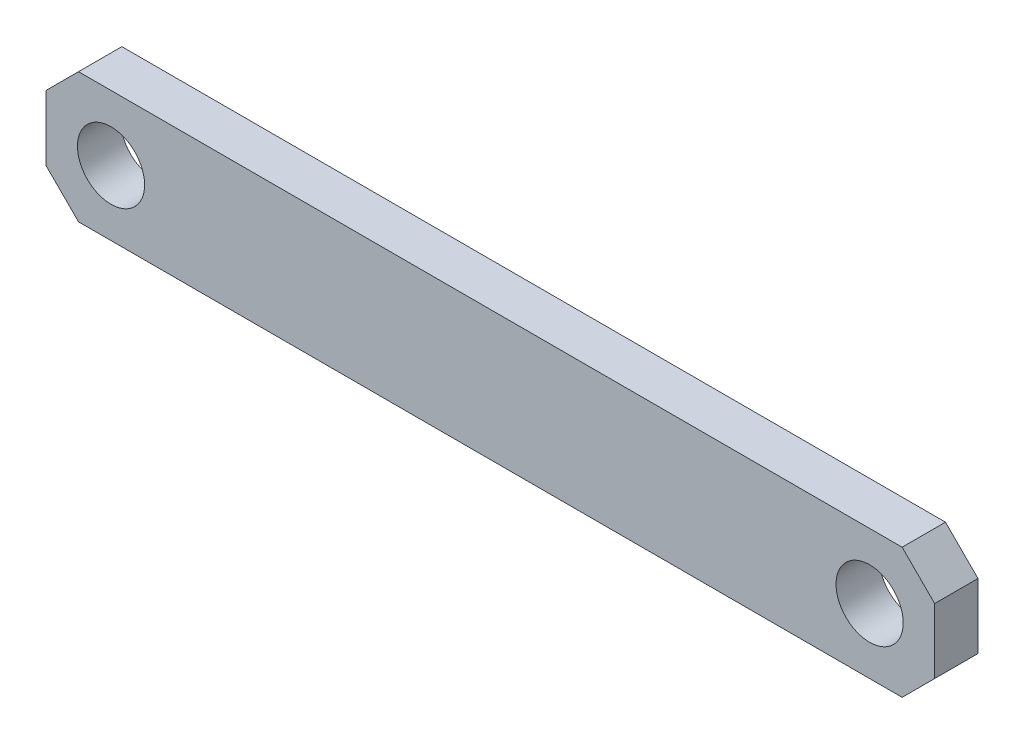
ISO-10303-21;
HEADER;
FILE_DESCRIPTION(('STEP AP214'),'2;1');
FILE_NAME('part.step','',(''),(''),'','','');
FILE_SCHEMA(('AUTOMOTIVE_DESIGN { 1 0 10303 214 1 1 1 1 }'));
ENDSEC;
DATA;
#1=APPLICATION_CONTEXT('core data for automotive mechanical design processes');
#2=APPLICATION_PROTOCOL_DEFINITION('international standard','automotive_design',2000,#1);
#3=PRODUCT_CONTEXT('',#1,'mechanical');
#4=PRODUCT('Part','Part','',(#3));
#5=PRODUCT_RELATED_PRODUCT_CATEGORY('part','',(#4));
#6=PRODUCT_DEFINITION_FORMATION('','',#4);
#7=PRODUCT_DEFINITION_CONTEXT('part definition',#1,'design');
#8=PRODUCT_DEFINITION('design','',#6,#7);
#9=PRODUCT_DEFINITION_SHAPE('','',#8);
#10=(LENGTH_UNIT() NAMED_UNIT(*) SI_UNIT(.MILLI.,.METRE.));
#11=(NAMED_UNIT(*) PLANE_ANGLE_UNIT() SI_UNIT($,.RADIAN.));
#12=(NAMED_UNIT(*) SI_UNIT($,.STERADIAN.) SOLID_ANGLE_UNIT());
#13=UNCERTAINTY_MEASURE_WITH_UNIT(LENGTH_MEASURE(1.E-05),#10,'distance_accuracy_value','');
#14=(GEOMETRIC_REPRESENTATION_CONTEXT(3) GLOBAL_UNCERTAINTY_ASSIGNED_CONTEXT((#13)) GLOBAL_UNIT_ASSIGNED_CONTEXT((#10,
#11,#12)) REPRESENTATION_CONTEXT('',''));
#15=CARTESIAN_POINT('',(0.,0.,0.));
#16=DIRECTION('',(0.,0.,1.));
#17=DIRECTION('',(1.,0.,0.));
#18=AXIS2_PLACEMENT_3D('',#15,#16,#17);
#19=CARTESIAN_POINT('',(-6.,2.99999999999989,-2.));
#20=DIRECTION('',(-1.,0.,0.));
#21=DIRECTION('',(0.,0.,1.));
#22=AXIS2_PLACEMENT_3D('',#19,#20,#21);
#23=PLANE('',#22);
#24=DIRECTION('',(0.,-1.,0.));
#25=VECTOR('',#24,1.);
#26=CARTESIAN_POINT('',(-6.,2.99999999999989,2.));
#27=LINE('',#26,#25);
#28=CARTESIAN_POINT('',(-6.,2.99999999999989,2.));
#29=VERTEX_POINT('',#28);
#30=CARTESIAN_POINT('',(-6.,-3.,2.));
#31=VERTEX_POINT('',#30);
#32=EDGE_CURVE('E139',#29,#31,#27,.T.);
#33=ORIENTED_EDGE('',*,*,#32,.F.);
#34=DIRECTION('',(0.,0.,1.));
#35=VECTOR('',#34,1.);
#36=CARTESIAN_POINT('',(-6.,2.99999999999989,-2.));
#37=LINE('',#36,#35);
#38=CARTESIAN_POINT('',(-6.,2.99999999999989,-2.));
#39=VERTEX_POINT('',#38);
#40=EDGE_CURVE('E11',#39,#29,#37,.T.);
#41=ORIENTED_EDGE('',*,*,#40,.F.);
#42=DIRECTION('',(0.,-1.,0.));
#43=VECTOR('',#42,1.);
#44=CARTESIAN_POINT('',(-6.,2.99999999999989,-2.));
#45=LINE('',#44,#43);
#46=CARTESIAN_POINT('',(-6.,-3.,-2.));
#47=VERTEX_POINT('',#46);
#48=EDGE_CURVE('E160',#39,#47,#45,.T.);
#49=ORIENTED_EDGE('',*,*,#48,.T.);
#50=DIRECTION('',(0.,0.,1.));
#51=VECTOR('',#50,1.);
#52=CARTESIAN_POINT('',(-6.,-3.,-2.));
#53=LINE('',#52,#51);
#54=EDGE_CURVE('E97',#47,#31,#53,.T.);
#55=ORIENTED_EDGE('',*,*,#54,.T.);
#56=EDGE_LOOP('',(#33,#41,#49,#55));
#57=FACE_BOUND('',#56,.T.);
#58=ADVANCED_FACE('F41',(#57),#23,.T.);
#59=CARTESIAN_POINT('',(-2.99999999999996,5.99999999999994,-2.));
#60=DIRECTION('',(-0.707106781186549,0.707106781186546,0.));
#61=DIRECTION('',(-0.707106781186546,-0.707106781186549,0.));
#62=AXIS2_PLACEMENT_3D('',#59,#60,#61);
#63=PLANE('',#62);
#64=DIRECTION('',(-0.707106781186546,-0.707106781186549,0.));
#65=VECTOR('',#64,1.);
#66=CARTESIAN_POINT('',(-2.99999999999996,5.99999999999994,2.));
#67=LINE('',#66,#65);
#68=CARTESIAN_POINT('',(-2.99999999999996,5.99999999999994,2.));
#69=VERTEX_POINT('',#68);
#70=EDGE_CURVE('E158',#69,#29,#67,.T.);
#71=ORIENTED_EDGE('',*,*,#70,.F.);
#72=DIRECTION('',(0.,0.,1.));
#73=VECTOR('',#72,1.);
#74=CARTESIAN_POINT('',(-2.99999999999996,5.99999999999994,-2.));
#75=LINE('',#74,#73);
#76=CARTESIAN_POINT('',(-2.99999999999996,5.99999999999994,-2.));
#77=VERTEX_POINT('',#76);
#78=EDGE_CURVE('E50',#77,#69,#75,.T.);
#79=ORIENTED_EDGE('',*,*,#78,.F.);
#80=DIRECTION('',(-0.707106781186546,-0.707106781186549,0.));
#81=VECTOR('',#80,1.);
#82=CARTESIAN_POINT('',(-2.99999999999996,5.99999999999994,-2.));
#83=LINE('',#82,#81);
#84=EDGE_CURVE('E129',#77,#39,#83,.T.);
#85=ORIENTED_EDGE('',*,*,#84,.T.);
#86=ORIENTED_EDGE('',*,*,#40,.T.);
#87=EDGE_LOOP('',(#71,#79,#85,#86));
#88=FACE_BOUND('',#87,.T.);
#89=ADVANCED_FACE('F201',(#88),#63,.T.);
#90=CARTESIAN_POINT('',(73.,5.99999999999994,-2.));
#91=DIRECTION('',(0.,1.,0.));
#92=DIRECTION('',(0.,0.,1.));
#93=AXIS2_PLACEMENT_3D('',#90,#91,#92);
#94=PLANE('',#93);
#95=DIRECTION('',(-1.,0.,0.));
#96=VECTOR('',#95,1.);
#97=CARTESIAN_POINT('',(73.,5.99999999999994,2.));
#98=LINE('',#97,#96);
#99=CARTESIAN_POINT('',(73.,5.99999999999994,2.));
#100=VERTEX_POINT('',#99);
#101=EDGE_CURVE('E116',#100,#69,#98,.T.);
#102=ORIENTED_EDGE('',*,*,#101,.F.);
#103=DIRECTION('',(0.,0.,1.));
#104=VECTOR('',#103,1.);
#105=CARTESIAN_POINT('',(73.,5.99999999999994,-2.));
#106=LINE('',#105,#104);
#107=CARTESIAN_POINT('',(73.,5.99999999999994,-2.));
#108=VERTEX_POINT('',#107);
#109=EDGE_CURVE('E111',#108,#100,#106,.T.);
#110=ORIENTED_EDGE('',*,*,#109,.F.);
#111=DIRECTION('',(-1.,0.,0.));
#112=VECTOR('',#111,1.);
#113=CARTESIAN_POINT('',(73.,5.99999999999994,-2.));
#114=LINE('',#113,#112);
#115=EDGE_CURVE('E114',#108,#77,#114,.T.);
#116=ORIENTED_EDGE('',*,*,#115,.T.);
#117=ORIENTED_EDGE('',*,*,#78,.T.);
#118=EDGE_LOOP('',(#102,#110,#116,#117));
#119=FACE_BOUND('',#118,.T.);
#120=ADVANCED_FACE('F113',(#119),#94,.T.);
#121=CARTESIAN_POINT('',(75.9999999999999,3.,-2.));
#122=DIRECTION('',(0.707106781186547,0.707106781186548,0.));
#123=DIRECTION('',(-0.707106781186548,0.707106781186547,0.));
#124=AXIS2_PLACEMENT_3D('',#121,#122,#123);
#125=PLANE('',#124);
#126=DIRECTION('',(-0.707106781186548,0.707106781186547,0.));
#127=VECTOR('',#126,1.);
#128=CARTESIAN_POINT('',(75.9999999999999,3.,2.));
#129=LINE('',#128,#127);
#130=CARTESIAN_POINT('',(75.9999999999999,3.,2.));
#131=VERTEX_POINT('',#130);
#132=EDGE_CURVE('E155',#131,#100,#129,.T.);
#133=ORIENTED_EDGE('',*,*,#132,.F.);
#134=DIRECTION('',(0.,0.,1.));
#135=VECTOR('',#134,1.);
#136=CARTESIAN_POINT('',(75.9999999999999,3.,-2.));
#137=LINE('',#136,#135);
#138=CARTESIAN_POINT('',(75.9999999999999,3.,-2.));
#139=VERTEX_POINT('',#138);
#140=EDGE_CURVE('E121',#139,#131,#137,.T.);
#141=ORIENTED_EDGE('',*,*,#140,.F.);
#142=DIRECTION('',(-0.707106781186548,0.707106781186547,0.));
#143=VECTOR('',#142,1.);
#144=CARTESIAN_POINT('',(75.9999999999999,3.,-2.));
#145=LINE('',#144,#143);
#146=EDGE_CURVE('E127',#139,#108,#145,.T.);
#147=ORIENTED_EDGE('',*,*,#146,.T.);
#148=ORIENTED_EDGE('',*,*,#109,.T.);
#149=EDGE_LOOP('',(#133,#141,#147,#148));
#150=FACE_BOUND('',#149,.T.);
#151=ADVANCED_FACE('F131',(#150),#125,.T.);
#152=CARTESIAN_POINT('',(75.9999999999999,-3.,-2.));
#153=DIRECTION('',(1.,0.,0.));
#154=DIRECTION('',(0.,0.,-1.));
#155=AXIS2_PLACEMENT_3D('',#152,#153,#154);
#156=PLANE('',#155);
#157=DIRECTION('',(0.,1.,0.));
#158=VECTOR('',#157,1.);
#159=CARTESIAN_POINT('',(75.9999999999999,-3.,2.));
#160=LINE('',#159,#158);
#161=CARTESIAN_POINT('',(75.9999999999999,-3.,2.));
#162=VERTEX_POINT('',#161);
#163=EDGE_CURVE('E152',#162,#131,#160,.T.);
#164=ORIENTED_EDGE('',*,*,#163,.F.);
#165=DIRECTION('',(0.,0.,1.));
#166=VECTOR('',#165,1.);
#167=CARTESIAN_POINT('',(75.9999999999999,-3.,-2.));
#168=LINE('',#167,#166);
#169=CARTESIAN_POINT('',(75.9999999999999,-3.,-2.));
#170=VERTEX_POINT('',#169);
#171=EDGE_CURVE('E164',#170,#162,#168,.T.);
#172=ORIENTED_EDGE('',*,*,#171,.F.);
#173=DIRECTION('',(0.,1.,0.));
#174=VECTOR('',#173,1.);
#175=CARTESIAN_POINT('',(75.9999999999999,-3.,-2.));
#176=LINE('',#175,#174);
#177=EDGE_CURVE('E132',#170,#139,#176,.T.);
#178=ORIENTED_EDGE('',*,*,#177,.T.);
#179=ORIENTED_EDGE('',*,*,#140,.T.);
#180=EDGE_LOOP('',(#164,#172,#178,#179));
#181=FACE_BOUND('',#180,.T.);
#182=ADVANCED_FACE('F214',(#181),#156,.T.);
#183=CARTESIAN_POINT('',(73.,-5.99999999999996,-2.));
#184=DIRECTION('',(0.70710678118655,-0.707106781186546,0.));
#185=DIRECTION('',(0.707106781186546,0.70710678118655,0.));
#186=AXIS2_PLACEMENT_3D('',#183,#184,#185);
#187=PLANE('',#186);
#188=DIRECTION('',(0.707106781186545,0.707106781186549,0.));
#189=VECTOR('',#188,1.);
#190=CARTESIAN_POINT('',(73.,-5.99999999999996,2.));
#191=LINE('',#190,#189);
#192=CARTESIAN_POINT('',(73.,-5.99999999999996,2.));
#193=VERTEX_POINT('',#192);
#194=EDGE_CURVE('E149',#193,#162,#191,.T.);
#195=ORIENTED_EDGE('',*,*,#194,.F.);
#196=DIRECTION('',(0.,0.,1.));
#197=VECTOR('',#196,1.);
#198=CARTESIAN_POINT('',(73.,-5.99999999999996,-2.));
#199=LINE('',#198,#197);
#200=CARTESIAN_POINT('',(73.,-5.99999999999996,-2.));
#201=VERTEX_POINT('',#200);
#202=EDGE_CURVE('E166',#201,#193,#199,.T.);
#203=ORIENTED_EDGE('',*,*,#202,.F.);
#204=DIRECTION('',(0.707106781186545,0.707106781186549,0.));
#205=VECTOR('',#204,1.);
#206=CARTESIAN_POINT('',(73.,-5.99999999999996,-2.));
#207=LINE('',#206,#205);
#208=EDGE_CURVE('E134',#201,#170,#207,.T.);
#209=ORIENTED_EDGE('',*,*,#208,.T.);
#210=ORIENTED_EDGE('',*,*,#171,.T.);
#211=EDGE_LOOP('',(#195,#203,#209,#210));
#212=FACE_BOUND('',#211,.T.);
#213=ADVANCED_FACE('F192',(#212),#187,.T.);
#214=CARTESIAN_POINT('',(-2.99999999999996,-5.99999999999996,-2.));
#215=DIRECTION('',(0.,-1.,0.));
#216=DIRECTION('',(0.,0.,-1.));
#217=AXIS2_PLACEMENT_3D('',#214,#215,#216);
#218=PLANE('',#217);
#219=DIRECTION('',(1.,0.,0.));
#220=VECTOR('',#219,1.);
#221=CARTESIAN_POINT('',(-2.99999999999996,-5.99999999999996,2.));
#222=LINE('',#221,#220);
#223=CARTESIAN_POINT('',(-2.99999999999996,-5.99999999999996,2.));
#224=VERTEX_POINT('',#223);
#225=EDGE_CURVE('E146',#224,#193,#222,.T.);
#226=ORIENTED_EDGE('',*,*,#225,.F.);
#227=DIRECTION('',(0.,0.,1.));
#228=VECTOR('',#227,1.);
#229=CARTESIAN_POINT('',(-2.99999999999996,-5.99999999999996,-2.));
#230=LINE('',#229,#228);
#231=CARTESIAN_POINT('',(-2.99999999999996,-5.99999999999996,-2.));
#232=VERTEX_POINT('',#231);
#233=EDGE_CURVE('E168',#232,#224,#230,.T.);
#234=ORIENTED_EDGE('',*,*,#233,.F.);
#235=DIRECTION('',(1.,0.,0.));
#236=VECTOR('',#235,1.);
#237=CARTESIAN_POINT('',(-2.99999999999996,-5.99999999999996,-2.));
#238=LINE('',#237,#236);
#239=EDGE_CURVE('E186',#232,#201,#238,.T.);
#240=ORIENTED_EDGE('',*,*,#239,.T.);
#241=ORIENTED_EDGE('',*,*,#202,.T.);
#242=EDGE_LOOP('',(#226,#234,#240,#241));
#243=FACE_BOUND('',#242,.T.);
#244=ADVANCED_FACE('F197',(#243),#218,.T.);
#245=CARTESIAN_POINT('',(-6.,-3.,-2.));
#246=DIRECTION('',(-0.707106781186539,-0.707106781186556,0.));
#247=DIRECTION('',(0.707106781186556,-0.707106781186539,0.));
#248=AXIS2_PLACEMENT_3D('',#245,#246,#247);
#249=PLANE('',#248);
#250=DIRECTION('',(0.707106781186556,-0.707106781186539,0.));
#251=VECTOR('',#250,1.);
#252=CARTESIAN_POINT('',(-6.,-3.,2.));
#253=LINE('',#252,#251);
#254=EDGE_CURVE('E142',#31,#224,#253,.T.);
#255=ORIENTED_EDGE('',*,*,#254,.F.);
#256=ORIENTED_EDGE('',*,*,#54,.F.);
#257=DIRECTION('',(0.707106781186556,-0.707106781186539,0.));
#258=VECTOR('',#257,1.);
#259=CARTESIAN_POINT('',(-6.,-3.,-2.));
#260=LINE('',#259,#258);
#261=EDGE_CURVE('E184',#47,#232,#260,.T.);
#262=ORIENTED_EDGE('',*,*,#261,.T.);
#263=ORIENTED_EDGE('',*,*,#233,.T.);
#264=EDGE_LOOP('',(#255,#256,#262,#263));
#265=FACE_BOUND('',#264,.T.);
#266=ADVANCED_FACE('F198',(#265),#249,.T.);
#267=CARTESIAN_POINT('',(0.,0.,-2.));
#268=DIRECTION('',(0.,0.,1.));
#269=DIRECTION('',(1.,0.,0.));
#270=AXIS2_PLACEMENT_3D('',#267,#268,#269);
#271=PLANE('',#270);
#272=CARTESIAN_POINT('',(0.,0.,-2.));
#273=DIRECTION('',(0.,0.,1.));
#274=DIRECTION('',(1.,0.,0.));
#275=AXIS2_PLACEMENT_3D('',#272,#273,#274);
#276=CIRCLE('',#275,3.1);
#277=CARTESIAN_POINT('',(3.1,0.,-2.));
#278=VERTEX_POINT('',#277);
#279=EDGE_CURVE('E143',#278,#278,#276,.T.);
#280=ORIENTED_EDGE('',*,*,#279,.T.);
#281=EDGE_LOOP('',(#280));
#282=FACE_BOUND('',#281,.T.);
#283=CARTESIAN_POINT('',(70.,0.,-2.));
#284=DIRECTION('',(0.,0.,1.));
#285=DIRECTION('',(1.,0.,0.));
#286=AXIS2_PLACEMENT_3D('',#283,#284,#285);
#287=CIRCLE('',#286,3.1);
#288=CARTESIAN_POINT('',(73.1,0.,-2.));
#289=VERTEX_POINT('',#288);
#290=EDGE_CURVE('E172',#289,#289,#287,.T.);
#291=ORIENTED_EDGE('',*,*,#290,.T.);
#292=EDGE_LOOP('',(#291));
#293=FACE_BOUND('',#292,.T.);
#294=ORIENTED_EDGE('',*,*,#48,.F.);
#295=ORIENTED_EDGE('',*,*,#84,.F.);
#296=ORIENTED_EDGE('',*,*,#115,.F.);
#297=ORIENTED_EDGE('',*,*,#146,.F.);
#298=ORIENTED_EDGE('',*,*,#177,.F.);
#299=ORIENTED_EDGE('',*,*,#208,.F.);
#300=ORIENTED_EDGE('',*,*,#239,.F.);
#301=ORIENTED_EDGE('',*,*,#261,.F.);
#302=EDGE_LOOP('',(#294,#295,#296,#297,#298,#299,#300,#301));
#303=FACE_BOUND('',#302,.T.);
#304=ADVANCED_FACE('F125',(#282,#293,#303),#271,.F.);
#305=CARTESIAN_POINT('',(0.,0.,2.));
#306=DIRECTION('',(0.,0.,1.));
#307=DIRECTION('',(1.,0.,0.));
#308=AXIS2_PLACEMENT_3D('',#305,#306,#307);
#309=PLANE('',#308);
#310=CARTESIAN_POINT('',(0.,0.,2.));
#311=DIRECTION('',(0.,0.,1.));
#312=DIRECTION('',(1.,0.,0.));
#313=AXIS2_PLACEMENT_3D('',#310,#311,#312);
#314=CIRCLE('',#313,3.1);
#315=CARTESIAN_POINT('',(3.1,0.,2.));
#316=VERTEX_POINT('',#315);
#317=EDGE_CURVE('E44',#316,#316,#314,.T.);
#318=ORIENTED_EDGE('',*,*,#317,.F.);
#319=EDGE_LOOP('',(#318));
#320=FACE_BOUND('',#319,.T.);
#321=CARTESIAN_POINT('',(70.,0.,2.));
#322=DIRECTION('',(0.,0.,1.));
#323=DIRECTION('',(1.,0.,0.));
#324=AXIS2_PLACEMENT_3D('',#321,#322,#323);
#325=CIRCLE('',#324,3.1);
#326=CARTESIAN_POINT('',(73.1,0.,2.));
#327=VERTEX_POINT('',#326);
#328=EDGE_CURVE('E170',#327,#327,#325,.T.);
#329=ORIENTED_EDGE('',*,*,#328,.F.);
#330=EDGE_LOOP('',(#329));
#331=FACE_BOUND('',#330,.T.);
#332=ORIENTED_EDGE('',*,*,#32,.T.);
#333=ORIENTED_EDGE('',*,*,#254,.T.);
#334=ORIENTED_EDGE('',*,*,#225,.T.);
#335=ORIENTED_EDGE('',*,*,#194,.T.);
#336=ORIENTED_EDGE('',*,*,#163,.T.);
#337=ORIENTED_EDGE('',*,*,#132,.T.);
#338=ORIENTED_EDGE('',*,*,#101,.T.);
#339=ORIENTED_EDGE('',*,*,#70,.T.);
#340=EDGE_LOOP('',(#332,#333,#334,#335,#336,#337,#338,#339));
#341=FACE_BOUND('',#340,.T.);
#342=ADVANCED_FACE('F200',(#320,#331,#341),#309,.T.);
#343=CARTESIAN_POINT('',(70.,0.,-250.));
#344=DIRECTION('',(0.,0.,1.));
#345=DIRECTION('',(1.,0.,0.));
#346=AXIS2_PLACEMENT_3D('',#343,#344,#345);
#347=CYLINDRICAL_SURFACE('',#346,3.1);
#348=ORIENTED_EDGE('',*,*,#328,.T.);
#349=EDGE_LOOP('',(#348));
#350=FACE_BOUND('',#349,.T.);
#351=ORIENTED_EDGE('',*,*,#290,.F.);
#352=EDGE_LOOP('',(#351));
#353=FACE_BOUND('',#352,.T.);
#354=ADVANCED_FACE('F229',(#350,#353),#347,.F.);
#355=CARTESIAN_POINT('',(0.,0.,-250.));
#356=DIRECTION('',(0.,0.,1.));
#357=DIRECTION('',(1.,0.,0.));
#358=AXIS2_PLACEMENT_3D('',#355,#356,#357);
#359=CYLINDRICAL_SURFACE('',#358,3.1);
#360=ORIENTED_EDGE('',*,*,#317,.T.);
#361=EDGE_LOOP('',(#360));
#362=FACE_BOUND('',#361,.T.);
#363=ORIENTED_EDGE('',*,*,#279,.F.);
#364=EDGE_LOOP('',(#363));
#365=FACE_BOUND('',#364,.T.);
#366=ADVANCED_FACE('F234',(#362,#365),#359,.F.);
#367=CLOSED_SHELL('',(#58,#89,#120,#151,#182,#213,#244,#266,#304,#342,#354,#366));
#368=MANIFOLD_SOLID_BREP('B2',#367);
#369=ADVANCED_BREP_SHAPE_REPRESENTATION('',(#18,#368),#14);
#370=SHAPE_DEFINITION_REPRESENTATION(#9,#369);
ENDSEC;
END-ISO-10303-21;
